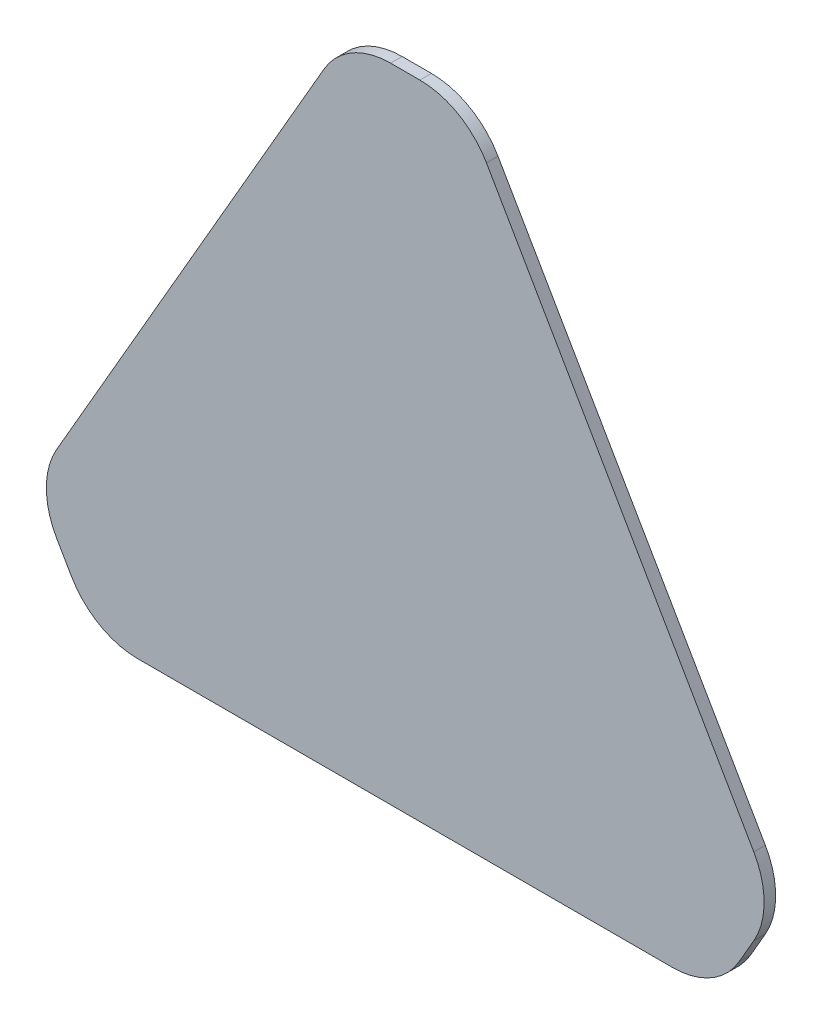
ISO-10303-21;
HEADER;
FILE_DESCRIPTION(('STEP AP214'),'2;1');
FILE_NAME('part.step','',(''),(''),'','','');
FILE_SCHEMA(('AUTOMOTIVE_DESIGN { 1 0 10303 214 1 1 1 1 }'));
ENDSEC;
DATA;
#1=APPLICATION_CONTEXT('core data for automotive mechanical design processes');
#2=APPLICATION_PROTOCOL_DEFINITION('international standard','automotive_design',2000,#1);
#3=PRODUCT_CONTEXT('',#1,'mechanical');
#4=PRODUCT('Part','Part','',(#3));
#5=PRODUCT_RELATED_PRODUCT_CATEGORY('part','',(#4));
#6=PRODUCT_DEFINITION_FORMATION('','',#4);
#7=PRODUCT_DEFINITION_CONTEXT('part definition',#1,'design');
#8=PRODUCT_DEFINITION('design','',#6,#7);
#9=PRODUCT_DEFINITION_SHAPE('','',#8);
#10=(LENGTH_UNIT() NAMED_UNIT(*) SI_UNIT(.MILLI.,.METRE.));
#11=(NAMED_UNIT(*) PLANE_ANGLE_UNIT() SI_UNIT($,.RADIAN.));
#12=(NAMED_UNIT(*) SI_UNIT($,.STERADIAN.) SOLID_ANGLE_UNIT());
#13=UNCERTAINTY_MEASURE_WITH_UNIT(LENGTH_MEASURE(1.E-05),#10,'distance_accuracy_value','');
#14=(GEOMETRIC_REPRESENTATION_CONTEXT(3) GLOBAL_UNCERTAINTY_ASSIGNED_CONTEXT((#13)) GLOBAL_UNIT_ASSIGNED_CONTEXT((#10,
#11,#12)) REPRESENTATION_CONTEXT('',''));
#15=CARTESIAN_POINT('',(0.,0.,0.));
#16=DIRECTION('',(0.,0.,1.));
#17=DIRECTION('',(1.,0.,0.));
#18=AXIS2_PLACEMENT_3D('',#15,#16,#17);
#19=CARTESIAN_POINT('',(3.81197846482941,82.5,3.));
#20=DIRECTION('',(0.,0.,-1.));
#21=DIRECTION('',(-1.,0.,0.));
#22=AXIS2_PLACEMENT_3D('',#19,#20,#21);
#23=CYLINDRICAL_SURFACE('',#22,20.);
#24=CARTESIAN_POINT('',(3.81197846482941,82.5,0.));
#25=DIRECTION('',(0.,0.,1.));
#26=DIRECTION('',(1.,0.,0.));
#27=AXIS2_PLACEMENT_3D('',#24,#25,#26);
#28=CIRCLE('',#27,20.);
#29=CARTESIAN_POINT('',(21.1324865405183,92.4999999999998,0.));
#30=VERTEX_POINT('',#29);
#31=CARTESIAN_POINT('',(3.8119784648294,102.5,0.));
#32=VERTEX_POINT('',#31);
#33=EDGE_CURVE('E159',#30,#32,#28,.T.);
#34=ORIENTED_EDGE('',*,*,#33,.T.);
#35=DIRECTION('',(0.,0.,-1.));
#36=VECTOR('',#35,1.);
#37=CARTESIAN_POINT('',(3.8119784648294,102.5,3.));
#38=LINE('',#37,#36);
#39=CARTESIAN_POINT('',(3.8119784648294,102.5,3.));
#40=VERTEX_POINT('',#39);
#41=EDGE_CURVE('E11',#40,#32,#38,.T.);
#42=ORIENTED_EDGE('',*,*,#41,.F.);
#43=CARTESIAN_POINT('',(3.81197846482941,82.5,3.));
#44=DIRECTION('',(0.,0.,1.));
#45=DIRECTION('',(1.,0.,0.));
#46=AXIS2_PLACEMENT_3D('',#43,#44,#45);
#47=CIRCLE('',#46,20.);
#48=CARTESIAN_POINT('',(21.1324865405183,92.4999999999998,3.));
#49=VERTEX_POINT('',#48);
#50=EDGE_CURVE('E181',#49,#40,#47,.T.);
#51=ORIENTED_EDGE('',*,*,#50,.F.);
#52=DIRECTION('',(0.,0.,-1.));
#53=VECTOR('',#52,1.);
#54=CARTESIAN_POINT('',(21.1324865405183,92.4999999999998,3.));
#55=LINE('',#54,#53);
#56=EDGE_CURVE('E155',#49,#30,#55,.T.);
#57=ORIENTED_EDGE('',*,*,#56,.T.);
#58=EDGE_LOOP('',(#34,#42,#51,#57));
#59=FACE_BOUND('',#58,.T.);
#60=ADVANCED_FACE('F39',(#59),#23,.T.);
#61=CARTESIAN_POINT('',(3.8119784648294,102.5,3.));
#62=DIRECTION('',(0.,-1.,0.));
#63=DIRECTION('',(0.,0.,-1.));
#64=AXIS2_PLACEMENT_3D('',#61,#62,#63);
#65=PLANE('',#64);
#66=DIRECTION('',(-1.,0.,0.));
#67=VECTOR('',#66,1.);
#68=CARTESIAN_POINT('',(3.8119784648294,102.5,0.));
#69=LINE('',#68,#67);
#70=CARTESIAN_POINT('',(-3.8119784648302,102.5,0.));
#71=VERTEX_POINT('',#70);
#72=EDGE_CURVE('E162',#32,#71,#69,.T.);
#73=ORIENTED_EDGE('',*,*,#72,.T.);
#74=DIRECTION('',(0.,0.,-1.));
#75=VECTOR('',#74,1.);
#76=CARTESIAN_POINT('',(-3.8119784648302,102.5,3.));
#77=LINE('',#76,#75);
#78=CARTESIAN_POINT('',(-3.8119784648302,102.5,3.));
#79=VERTEX_POINT('',#78);
#80=EDGE_CURVE('E47',#79,#71,#77,.T.);
#81=ORIENTED_EDGE('',*,*,#80,.F.);
#82=DIRECTION('',(-1.,0.,0.));
#83=VECTOR('',#82,1.);
#84=CARTESIAN_POINT('',(3.8119784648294,102.5,3.));
#85=LINE('',#84,#83);
#86=EDGE_CURVE('E110',#40,#79,#85,.T.);
#87=ORIENTED_EDGE('',*,*,#86,.F.);
#88=ORIENTED_EDGE('',*,*,#41,.T.);
#89=EDGE_LOOP('',(#73,#81,#87,#88));
#90=FACE_BOUND('',#89,.T.);
#91=ADVANCED_FACE('F259',(#90),#65,.F.);
#92=CARTESIAN_POINT('',(-3.8119784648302,82.5,3.));
#93=DIRECTION('',(0.,0.,-1.));
#94=DIRECTION('',(-1.,0.,0.));
#95=AXIS2_PLACEMENT_3D('',#92,#93,#94);
#96=CYLINDRICAL_SURFACE('',#95,20.);
#97=CARTESIAN_POINT('',(-3.8119784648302,82.5,0.));
#98=DIRECTION('',(0.,0.,1.));
#99=DIRECTION('',(1.,0.,0.));
#100=AXIS2_PLACEMENT_3D('',#97,#98,#99);
#101=CIRCLE('',#100,20.);
#102=CARTESIAN_POINT('',(-21.1324865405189,92.5000000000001,0.));
#103=VERTEX_POINT('',#102);
#104=EDGE_CURVE('E164',#71,#103,#101,.T.);
#105=ORIENTED_EDGE('',*,*,#104,.T.);
#106=DIRECTION('',(0.,0.,-1.));
#107=VECTOR('',#106,1.);
#108=CARTESIAN_POINT('',(-21.1324865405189,92.5000000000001,3.));
#109=LINE('',#108,#107);
#110=CARTESIAN_POINT('',(-21.1324865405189,92.5000000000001,3.));
#111=VERTEX_POINT('',#110);
#112=EDGE_CURVE('E200',#111,#103,#109,.T.);
#113=ORIENTED_EDGE('',*,*,#112,.F.);
#114=CARTESIAN_POINT('',(-3.8119784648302,82.5,3.));
#115=DIRECTION('',(0.,0.,1.));
#116=DIRECTION('',(1.,0.,0.));
#117=AXIS2_PLACEMENT_3D('',#114,#115,#116);
#118=CIRCLE('',#117,20.);
#119=EDGE_CURVE('E208',#79,#111,#118,.T.);
#120=ORIENTED_EDGE('',*,*,#119,.F.);
#121=ORIENTED_EDGE('',*,*,#80,.T.);
#122=EDGE_LOOP('',(#105,#113,#120,#121));
#123=FACE_BOUND('',#122,.T.);
#124=ADVANCED_FACE('F206',(#123),#96,.T.);
#125=CARTESIAN_POINT('',(-21.1324865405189,92.5000000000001,3.));
#126=DIRECTION('',(0.866025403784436,-0.500000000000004,0.));
#127=DIRECTION('',(0.500000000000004,0.866025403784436,0.));
#128=AXIS2_PLACEMENT_3D('',#125,#126,#127);
#129=PLANE('',#128);
#130=DIRECTION('',(-0.500000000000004,-0.866025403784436,0.));
#131=VECTOR('',#130,1.);
#132=CARTESIAN_POINT('',(-21.1324865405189,92.5000000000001,0.));
#133=LINE('',#132,#131);
#134=CARTESIAN_POINT('',(-90.6735931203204,-27.9487298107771,0.));
#135=VERTEX_POINT('',#134);
#136=EDGE_CURVE('E166',#103,#135,#133,.T.);
#137=ORIENTED_EDGE('',*,*,#136,.T.);
#138=DIRECTION('',(0.,0.,-1.));
#139=VECTOR('',#138,1.);
#140=CARTESIAN_POINT('',(-90.6735931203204,-27.9487298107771,3.));
#141=LINE('',#140,#139);
#142=CARTESIAN_POINT('',(-90.6735931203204,-27.9487298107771,3.));
#143=VERTEX_POINT('',#142);
#144=EDGE_CURVE('E197',#143,#135,#141,.T.);
#145=ORIENTED_EDGE('',*,*,#144,.F.);
#146=DIRECTION('',(-0.500000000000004,-0.866025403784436,0.));
#147=VECTOR('',#146,1.);
#148=CARTESIAN_POINT('',(-21.1324865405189,92.5000000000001,3.));
#149=LINE('',#148,#147);
#150=EDGE_CURVE('E226',#111,#143,#149,.T.);
#151=ORIENTED_EDGE('',*,*,#150,.F.);
#152=ORIENTED_EDGE('',*,*,#112,.T.);
#153=EDGE_LOOP('',(#137,#145,#151,#152));
#154=FACE_BOUND('',#153,.T.);
#155=ADVANCED_FACE('F217',(#154),#129,.F.);
#156=CARTESIAN_POINT('',(-73.3530850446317,-37.9487298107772,3.));
#157=DIRECTION('',(0.,0.,-1.));
#158=DIRECTION('',(-1.,0.,0.));
#159=AXIS2_PLACEMENT_3D('',#156,#157,#158);
#160=CYLINDRICAL_SURFACE('',#159,20.);
#161=CARTESIAN_POINT('',(-73.3530850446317,-37.9487298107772,0.));
#162=DIRECTION('',(0.,0.,1.));
#163=DIRECTION('',(1.,0.,0.));
#164=AXIS2_PLACEMENT_3D('',#161,#162,#163);
#165=CIRCLE('',#164,20.);
#166=CARTESIAN_POINT('',(-90.6735931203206,-47.948729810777,0.));
#167=VERTEX_POINT('',#166);
#168=EDGE_CURVE('E168',#135,#167,#165,.T.);
#169=ORIENTED_EDGE('',*,*,#168,.T.);
#170=DIRECTION('',(0.,0.,-1.));
#171=VECTOR('',#170,1.);
#172=CARTESIAN_POINT('',(-90.6735931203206,-47.948729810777,3.));
#173=LINE('',#172,#171);
#174=CARTESIAN_POINT('',(-90.6735931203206,-47.948729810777,3.));
#175=VERTEX_POINT('',#174);
#176=EDGE_CURVE('E194',#175,#167,#173,.T.);
#177=ORIENTED_EDGE('',*,*,#176,.F.);
#178=CARTESIAN_POINT('',(-73.3530850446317,-37.9487298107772,3.));
#179=DIRECTION('',(0.,0.,1.));
#180=DIRECTION('',(1.,0.,0.));
#181=AXIS2_PLACEMENT_3D('',#178,#179,#180);
#182=CIRCLE('',#181,20.);
#183=EDGE_CURVE('E223',#143,#175,#182,.T.);
#184=ORIENTED_EDGE('',*,*,#183,.F.);
#185=ORIENTED_EDGE('',*,*,#144,.T.);
#186=EDGE_LOOP('',(#169,#177,#184,#185));
#187=FACE_BOUND('',#186,.T.);
#188=ADVANCED_FACE('F221',(#187),#160,.T.);
#189=CARTESIAN_POINT('',(-90.6735931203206,-47.948729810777,3.));
#190=DIRECTION('',(0.866025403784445,0.499999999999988,0.));
#191=DIRECTION('',(-0.499999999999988,0.866025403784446,0.));
#192=AXIS2_PLACEMENT_3D('',#189,#190,#191);
#193=PLANE('',#192);
#194=DIRECTION('',(0.499999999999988,-0.866025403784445,0.));
#195=VECTOR('',#194,1.);
#196=CARTESIAN_POINT('',(-90.6735931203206,-47.948729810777,0.));
#197=LINE('',#196,#195);
#198=CARTESIAN_POINT('',(-86.8616146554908,-54.5512701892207,0.));
#199=VERTEX_POINT('',#198);
#200=EDGE_CURVE('E170',#167,#199,#197,.T.);
#201=ORIENTED_EDGE('',*,*,#200,.T.);
#202=DIRECTION('',(0.,0.,-1.));
#203=VECTOR('',#202,1.);
#204=CARTESIAN_POINT('',(-86.8616146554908,-54.5512701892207,3.));
#205=LINE('',#204,#203);
#206=CARTESIAN_POINT('',(-86.8616146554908,-54.5512701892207,3.));
#207=VERTEX_POINT('',#206);
#208=EDGE_CURVE('E191',#207,#199,#205,.T.);
#209=ORIENTED_EDGE('',*,*,#208,.F.);
#210=DIRECTION('',(0.499999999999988,-0.866025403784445,0.));
#211=VECTOR('',#210,1.);
#212=CARTESIAN_POINT('',(-90.6735931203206,-47.948729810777,3.));
#213=LINE('',#212,#211);
#214=EDGE_CURVE('E225',#175,#207,#213,.T.);
#215=ORIENTED_EDGE('',*,*,#214,.F.);
#216=ORIENTED_EDGE('',*,*,#176,.T.);
#217=EDGE_LOOP('',(#201,#209,#215,#216));
#218=FACE_BOUND('',#217,.T.);
#219=ADVANCED_FACE('F272',(#218),#193,.F.);
#220=CARTESIAN_POINT('',(-69.5411065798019,-44.5512701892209,3.));
#221=DIRECTION('',(0.,0.,-1.));
#222=DIRECTION('',(-1.,0.,0.));
#223=AXIS2_PLACEMENT_3D('',#220,#221,#222);
#224=CYLINDRICAL_SURFACE('',#223,20.);
#225=CARTESIAN_POINT('',(-69.5411065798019,-44.5512701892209,0.));
#226=DIRECTION('',(0.,0.,1.));
#227=DIRECTION('',(1.,0.,0.));
#228=AXIS2_PLACEMENT_3D('',#225,#226,#227);
#229=CIRCLE('',#228,20.);
#230=CARTESIAN_POINT('',(-69.5411065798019,-64.5512701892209,0.));
#231=VERTEX_POINT('',#230);
#232=EDGE_CURVE('E172',#199,#231,#229,.T.);
#233=ORIENTED_EDGE('',*,*,#232,.T.);
#234=DIRECTION('',(0.,0.,-1.));
#235=VECTOR('',#234,1.);
#236=CARTESIAN_POINT('',(-69.5411065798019,-64.5512701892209,3.));
#237=LINE('',#236,#235);
#238=CARTESIAN_POINT('',(-69.5411065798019,-64.5512701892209,3.));
#239=VERTEX_POINT('',#238);
#240=EDGE_CURVE('E188',#239,#231,#237,.T.);
#241=ORIENTED_EDGE('',*,*,#240,.F.);
#242=CARTESIAN_POINT('',(-69.5411065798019,-44.5512701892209,3.));
#243=DIRECTION('',(0.,0.,1.));
#244=DIRECTION('',(1.,0.,0.));
#245=AXIS2_PLACEMENT_3D('',#242,#243,#244);
#246=CIRCLE('',#245,20.);
#247=EDGE_CURVE('E228',#207,#239,#246,.T.);
#248=ORIENTED_EDGE('',*,*,#247,.F.);
#249=ORIENTED_EDGE('',*,*,#208,.T.);
#250=EDGE_LOOP('',(#233,#241,#248,#249));
#251=FACE_BOUND('',#250,.T.);
#252=ADVANCED_FACE('F275',(#251),#224,.T.);
#253=CARTESIAN_POINT('',(-69.5411065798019,-64.5512701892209,3.));
#254=DIRECTION('',(0.,1.,0.));
#255=DIRECTION('',(0.,0.,1.));
#256=AXIS2_PLACEMENT_3D('',#253,#254,#255);
#257=PLANE('',#256);
#258=DIRECTION('',(1.,0.,0.));
#259=VECTOR('',#258,1.);
#260=CARTESIAN_POINT('',(-69.5411065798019,-64.5512701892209,0.));
#261=LINE('',#260,#259);
#262=CARTESIAN_POINT('',(69.541106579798,-64.5512701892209,0.));
#263=VERTEX_POINT('',#262);
#264=EDGE_CURVE('E174',#231,#263,#261,.T.);
#265=ORIENTED_EDGE('',*,*,#264,.T.);
#266=DIRECTION('',(0.,0.,-1.));
#267=VECTOR('',#266,1.);
#268=CARTESIAN_POINT('',(69.541106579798,-64.5512701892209,3.));
#269=LINE('',#268,#267);
#270=CARTESIAN_POINT('',(69.541106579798,-64.5512701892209,3.));
#271=VERTEX_POINT('',#270);
#272=EDGE_CURVE('E185',#271,#263,#269,.T.);
#273=ORIENTED_EDGE('',*,*,#272,.F.);
#274=DIRECTION('',(1.,0.,0.));
#275=VECTOR('',#274,1.);
#276=CARTESIAN_POINT('',(-69.5411065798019,-64.5512701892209,3.));
#277=LINE('',#276,#275);
#278=EDGE_CURVE('E234',#239,#271,#277,.T.);
#279=ORIENTED_EDGE('',*,*,#278,.F.);
#280=ORIENTED_EDGE('',*,*,#240,.T.);
#281=EDGE_LOOP('',(#265,#273,#279,#280));
#282=FACE_BOUND('',#281,.T.);
#283=ADVANCED_FACE('F240',(#282),#257,.F.);
#284=CARTESIAN_POINT('',(69.541106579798,-44.5512701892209,3.));
#285=DIRECTION('',(0.,0.,-1.));
#286=DIRECTION('',(-1.,0.,0.));
#287=AXIS2_PLACEMENT_3D('',#284,#285,#286);
#288=CYLINDRICAL_SURFACE('',#287,20.);
#289=CARTESIAN_POINT('',(69.541106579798,-44.5512701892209,0.));
#290=DIRECTION('',(0.,0.,1.));
#291=DIRECTION('',(1.,0.,0.));
#292=AXIS2_PLACEMENT_3D('',#289,#290,#291);
#293=CIRCLE('',#292,20.);
#294=CARTESIAN_POINT('',(86.8616146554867,-54.5512701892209,0.));
#295=VERTEX_POINT('',#294);
#296=EDGE_CURVE('E176',#263,#295,#293,.T.);
#297=ORIENTED_EDGE('',*,*,#296,.T.);
#298=DIRECTION('',(0.,0.,-1.));
#299=VECTOR('',#298,1.);
#300=CARTESIAN_POINT('',(86.8616146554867,-54.5512701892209,3.));
#301=LINE('',#300,#299);
#302=CARTESIAN_POINT('',(86.8616146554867,-54.5512701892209,3.));
#303=VERTEX_POINT('',#302);
#304=EDGE_CURVE('E150',#303,#295,#301,.T.);
#305=ORIENTED_EDGE('',*,*,#304,.F.);
#306=CARTESIAN_POINT('',(69.541106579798,-44.5512701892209,3.));
#307=DIRECTION('',(0.,0.,1.));
#308=DIRECTION('',(1.,0.,0.));
#309=AXIS2_PLACEMENT_3D('',#306,#307,#308);
#310=CIRCLE('',#309,20.);
#311=EDGE_CURVE('E141',#271,#303,#310,.T.);
#312=ORIENTED_EDGE('',*,*,#311,.F.);
#313=ORIENTED_EDGE('',*,*,#272,.T.);
#314=EDGE_LOOP('',(#297,#305,#312,#313));
#315=FACE_BOUND('',#314,.T.);
#316=ADVANCED_FACE('F244',(#315),#288,.T.);
#317=CARTESIAN_POINT('',(86.8616146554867,-54.5512701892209,3.));
#318=DIRECTION('',(-0.866025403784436,0.500000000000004,0.));
#319=DIRECTION('',(-0.500000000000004,-0.866025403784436,0.));
#320=AXIS2_PLACEMENT_3D('',#317,#318,#319);
#321=PLANE('',#320);
#322=DIRECTION('',(0.500000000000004,0.866025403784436,0.));
#323=VECTOR('',#322,1.);
#324=CARTESIAN_POINT('',(86.8616146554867,-54.5512701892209,0.));
#325=LINE('',#324,#323);
#326=CARTESIAN_POINT('',(90.6735931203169,-47.9487298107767,0.));
#327=VERTEX_POINT('',#326);
#328=EDGE_CURVE('E149',#295,#327,#325,.T.);
#329=ORIENTED_EDGE('',*,*,#328,.T.);
#330=DIRECTION('',(0.,0.,-1.));
#331=VECTOR('',#330,1.);
#332=CARTESIAN_POINT('',(90.6735931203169,-47.9487298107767,3.));
#333=LINE('',#332,#331);
#334=CARTESIAN_POINT('',(90.6735931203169,-47.9487298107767,3.));
#335=VERTEX_POINT('',#334);
#336=EDGE_CURVE('E146',#335,#327,#333,.T.);
#337=ORIENTED_EDGE('',*,*,#336,.F.);
#338=DIRECTION('',(0.500000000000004,0.866025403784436,0.));
#339=VECTOR('',#338,1.);
#340=CARTESIAN_POINT('',(86.8616146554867,-54.5512701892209,3.));
#341=LINE('',#340,#339);
#342=EDGE_CURVE('E135',#303,#335,#341,.T.);
#343=ORIENTED_EDGE('',*,*,#342,.F.);
#344=ORIENTED_EDGE('',*,*,#304,.T.);
#345=EDGE_LOOP('',(#329,#337,#343,#344));
#346=FACE_BOUND('',#345,.T.);
#347=ADVANCED_FACE('F147',(#346),#321,.F.);
#348=CARTESIAN_POINT('',(73.3530850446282,-37.9487298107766,3.));
#349=DIRECTION('',(0.,0.,-1.));
#350=DIRECTION('',(-1.,0.,0.));
#351=AXIS2_PLACEMENT_3D('',#348,#349,#350);
#352=CYLINDRICAL_SURFACE('',#351,20.);
#353=CARTESIAN_POINT('',(73.3530850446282,-37.9487298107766,0.));
#354=DIRECTION('',(0.,0.,1.));
#355=DIRECTION('',(1.,0.,0.));
#356=AXIS2_PLACEMENT_3D('',#353,#354,#355);
#357=CIRCLE('',#356,20.);
#358=CARTESIAN_POINT('',(90.6735931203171,-27.9487298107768,0.));
#359=VERTEX_POINT('',#358);
#360=EDGE_CURVE('E96',#327,#359,#357,.T.);
#361=ORIENTED_EDGE('',*,*,#360,.T.);
#362=DIRECTION('',(0.,0.,-1.));
#363=VECTOR('',#362,1.);
#364=CARTESIAN_POINT('',(90.6735931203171,-27.9487298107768,3.));
#365=LINE('',#364,#363);
#366=CARTESIAN_POINT('',(90.6735931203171,-27.9487298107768,3.));
#367=VERTEX_POINT('',#366);
#368=EDGE_CURVE('E151',#367,#359,#365,.T.);
#369=ORIENTED_EDGE('',*,*,#368,.F.);
#370=CARTESIAN_POINT('',(73.3530850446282,-37.9487298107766,3.));
#371=DIRECTION('',(0.,0.,1.));
#372=DIRECTION('',(1.,0.,0.));
#373=AXIS2_PLACEMENT_3D('',#370,#371,#372);
#374=CIRCLE('',#373,20.);
#375=EDGE_CURVE('E139',#335,#367,#374,.T.);
#376=ORIENTED_EDGE('',*,*,#375,.F.);
#377=ORIENTED_EDGE('',*,*,#336,.T.);
#378=EDGE_LOOP('',(#361,#369,#376,#377));
#379=FACE_BOUND('',#378,.T.);
#380=ADVANCED_FACE('F153',(#379),#352,.T.);
#381=CARTESIAN_POINT('',(90.6735931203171,-27.9487298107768,3.));
#382=DIRECTION('',(-0.866025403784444,-0.499999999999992,0.));
#383=DIRECTION('',(0.499999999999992,-0.866025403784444,0.));
#384=AXIS2_PLACEMENT_3D('',#381,#382,#383);
#385=PLANE('',#384);
#386=DIRECTION('',(-0.499999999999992,0.866025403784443,0.));
#387=VECTOR('',#386,1.);
#388=CARTESIAN_POINT('',(90.6735931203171,-27.9487298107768,0.));
#389=LINE('',#388,#387);
#390=EDGE_CURVE('E102',#359,#30,#389,.T.);
#391=ORIENTED_EDGE('',*,*,#390,.T.);
#392=ORIENTED_EDGE('',*,*,#56,.F.);
#393=DIRECTION('',(-0.499999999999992,0.866025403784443,0.));
#394=VECTOR('',#393,1.);
#395=CARTESIAN_POINT('',(90.6735931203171,-27.9487298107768,3.));
#396=LINE('',#395,#394);
#397=EDGE_CURVE('E55',#367,#49,#396,.T.);
#398=ORIENTED_EDGE('',*,*,#397,.F.);
#399=ORIENTED_EDGE('',*,*,#368,.T.);
#400=EDGE_LOOP('',(#391,#392,#398,#399));
#401=FACE_BOUND('',#400,.T.);
#402=ADVANCED_FACE('F248',(#401),#385,.F.);
#403=CARTESIAN_POINT('',(3.81197846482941,82.5,3.));
#404=DIRECTION('',(0.,0.,1.));
#405=DIRECTION('',(1.,0.,0.));
#406=AXIS2_PLACEMENT_3D('',#403,#404,#405);
#407=PLANE('',#406);
#408=ORIENTED_EDGE('',*,*,#50,.T.);
#409=ORIENTED_EDGE('',*,*,#86,.T.);
#410=ORIENTED_EDGE('',*,*,#119,.T.);
#411=ORIENTED_EDGE('',*,*,#150,.T.);
#412=ORIENTED_EDGE('',*,*,#183,.T.);
#413=ORIENTED_EDGE('',*,*,#214,.T.);
#414=ORIENTED_EDGE('',*,*,#247,.T.);
#415=ORIENTED_EDGE('',*,*,#278,.T.);
#416=ORIENTED_EDGE('',*,*,#311,.T.);
#417=ORIENTED_EDGE('',*,*,#342,.T.);
#418=ORIENTED_EDGE('',*,*,#375,.T.);
#419=ORIENTED_EDGE('',*,*,#397,.T.);
#420=EDGE_LOOP('',(#408,#409,#410,#411,#412,#413,#414,#415,#416,#417,#418,#419));
#421=FACE_BOUND('',#420,.T.);
#422=ADVANCED_FACE('F137',(#421),#407,.T.);
#423=CARTESIAN_POINT('',(3.81197846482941,82.5,0.));
#424=DIRECTION('',(0.,0.,1.));
#425=DIRECTION('',(1.,0.,0.));
#426=AXIS2_PLACEMENT_3D('',#423,#424,#425);
#427=PLANE('',#426);
#428=ORIENTED_EDGE('',*,*,#33,.F.);
#429=ORIENTED_EDGE('',*,*,#390,.F.);
#430=ORIENTED_EDGE('',*,*,#360,.F.);
#431=ORIENTED_EDGE('',*,*,#328,.F.);
#432=ORIENTED_EDGE('',*,*,#296,.F.);
#433=ORIENTED_EDGE('',*,*,#264,.F.);
#434=ORIENTED_EDGE('',*,*,#232,.F.);
#435=ORIENTED_EDGE('',*,*,#200,.F.);
#436=ORIENTED_EDGE('',*,*,#168,.F.);
#437=ORIENTED_EDGE('',*,*,#136,.F.);
#438=ORIENTED_EDGE('',*,*,#104,.F.);
#439=ORIENTED_EDGE('',*,*,#72,.F.);
#440=EDGE_LOOP('',(#428,#429,#430,#431,#432,#433,#434,#435,#436,#437,#438,#439));
#441=FACE_BOUND('',#440,.T.);
#442=ADVANCED_FACE('F212',(#441),#427,.F.);
#443=CLOSED_SHELL('',(#60,#91,#124,#155,#188,#219,#252,#283,#316,#347,#380,#402,#422,#442));
#444=MANIFOLD_SOLID_BREP('B2',#443);
#445=ADVANCED_BREP_SHAPE_REPRESENTATION('',(#18,#444),#14);
#446=SHAPE_DEFINITION_REPRESENTATION(#9,#445);
ENDSEC;
END-ISO-10303-21;
